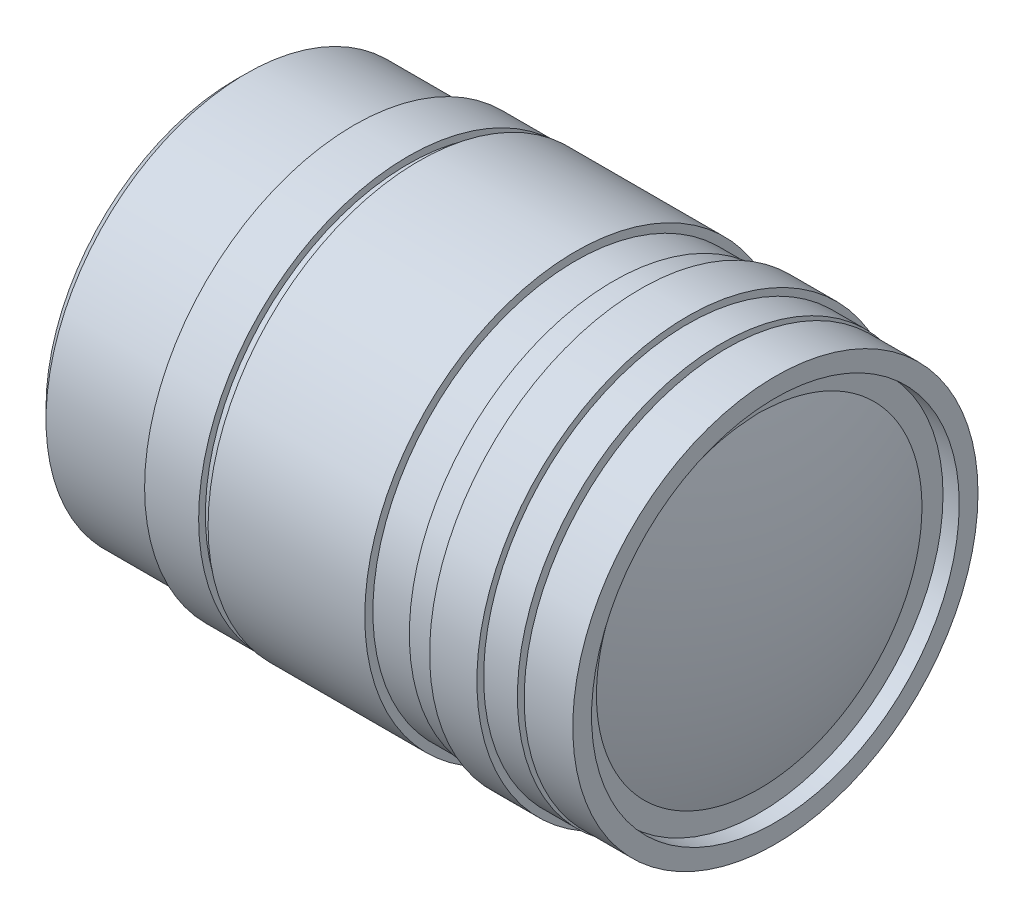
ISO-10303-21;
HEADER;
FILE_DESCRIPTION(('STEP AP214'),'2;1');
FILE_NAME('part.step','',(''),(''),'','','');
FILE_SCHEMA(('AUTOMOTIVE_DESIGN { 1 0 10303 214 1 1 1 1 }'));
ENDSEC;
DATA;
#1=APPLICATION_CONTEXT('core data for automotive mechanical design processes');
#2=APPLICATION_PROTOCOL_DEFINITION('international standard','automotive_design',2000,#1);
#3=PRODUCT_CONTEXT('',#1,'mechanical');
#4=PRODUCT('Part','Part','',(#3));
#5=PRODUCT_RELATED_PRODUCT_CATEGORY('part','',(#4));
#6=PRODUCT_DEFINITION_FORMATION('','',#4);
#7=PRODUCT_DEFINITION_CONTEXT('part definition',#1,'design');
#8=PRODUCT_DEFINITION('design','',#6,#7);
#9=PRODUCT_DEFINITION_SHAPE('','',#8);
#10=(LENGTH_UNIT() NAMED_UNIT(*) SI_UNIT(.MILLI.,.METRE.));
#11=(NAMED_UNIT(*) PLANE_ANGLE_UNIT() SI_UNIT($,.RADIAN.));
#12=(NAMED_UNIT(*) SI_UNIT($,.STERADIAN.) SOLID_ANGLE_UNIT());
#13=UNCERTAINTY_MEASURE_WITH_UNIT(LENGTH_MEASURE(1.E-05),#10,'distance_accuracy_value','');
#14=(GEOMETRIC_REPRESENTATION_CONTEXT(3) GLOBAL_UNCERTAINTY_ASSIGNED_CONTEXT((#13)) GLOBAL_UNIT_ASSIGNED_CONTEXT((#10,
#11,#12)) REPRESENTATION_CONTEXT('',''));
#15=CARTESIAN_POINT('',(0.,0.,0.));
#16=DIRECTION('',(0.,0.,1.));
#17=DIRECTION('',(1.,0.,0.));
#18=AXIS2_PLACEMENT_3D('',#15,#16,#17);
#19=CARTESIAN_POINT('',(0.,0.,0.));
#20=DIRECTION('',(-0.999985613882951,-0.00536395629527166,0.));
#21=DIRECTION('',(-0.00536395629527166,0.999985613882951,0.));
#22=AXIS2_PLACEMENT_3D('',#19,#20,#21);
#23=SPHERICAL_SURFACE('',#22,101.58576898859);
#24=CARTESIAN_POINT('',(95.2123995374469,0.510722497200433,0.));
#25=DIRECTION('',(-0.999985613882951,-0.00536395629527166,0.));
#26=DIRECTION('',(0.00536395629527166,-0.999985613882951,0.));
#27=AXIS2_PLACEMENT_3D('',#24,#25,#26);
#28=CIRCLE('',#27,35.4119555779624);
#29=CARTESIAN_POINT('',(95.4023477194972,-34.9007236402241,0.));
#30=VERTEX_POINT('',#29);
#31=EDGE_CURVE('E58',#30,#30,#28,.T.);
#32=ORIENTED_EDGE('',*,*,#31,.F.);
#33=EDGE_LOOP('',(#32));
#34=FACE_BOUND('',#33,.T.);
#35=ADVANCED_FACE('F51',(#34),#23,.T.);
#36=CARTESIAN_POINT('',(92.5515747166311,0.496449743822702,0.));
#37=DIRECTION('',(0.999985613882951,0.00536395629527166,0.));
#38=DIRECTION('',(-0.00536395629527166,0.999985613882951,0.));
#39=AXIS2_PLACEMENT_3D('',#36,#37,#38);
#40=CONICAL_SURFACE('',#39,35.4262285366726,1.56543234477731);
#41=CARTESIAN_POINT('',(92.361549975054,0.495430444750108,0.));
#42=VERTEX_POINT('',#41);
#43=VERTEX_LOOP('',#42);
#44=FACE_BOUND('',#43,.T.);
#45=CARTESIAN_POINT('',(92.5515747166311,0.496449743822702,0.));
#46=DIRECTION('',(-0.999985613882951,-0.00536395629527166,0.));
#47=DIRECTION('',(0.00536395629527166,-0.999985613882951,0.));
#48=AXIS2_PLACEMENT_3D('',#45,#46,#47);
#49=CIRCLE('',#48,35.4262285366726);
#50=CARTESIAN_POINT('',(92.7415994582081,-34.9292691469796,0.));
#51=VERTEX_POINT('',#50);
#52=EDGE_CURVE('E12',#51,#51,#49,.T.);
#53=ORIENTED_EDGE('',*,*,#52,.T.);
#54=EDGE_LOOP('',(#53));
#55=FACE_BOUND('',#54,.T.);
#56=ADVANCED_FACE('F62',(#44,#55),#40,.T.);
#57=CARTESIAN_POINT('',(95.2123995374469,0.510722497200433,0.));
#58=DIRECTION('',(-0.999985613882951,-0.00536395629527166,0.));
#59=DIRECTION('',(0.00536395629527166,-0.999985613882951,0.));
#60=AXIS2_PLACEMENT_3D('',#57,#58,#59);
#61=CONICAL_SURFACE('',#60,35.4119555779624,0.0053639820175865);
#62=ORIENTED_EDGE('',*,*,#52,.F.);
#63=EDGE_LOOP('',(#62));
#64=FACE_BOUND('',#63,.T.);
#65=ORIENTED_EDGE('',*,*,#31,.T.);
#66=EDGE_LOOP('',(#65));
#67=FACE_BOUND('',#66,.T.);
#68=ADVANCED_FACE('F65',(#64,#67),#61,.T.);
#69=CLOSED_SHELL('',(#35,#56,#68));
#70=MANIFOLD_SOLID_BREP('B2',#69);
#71=CARTESIAN_POINT('',(83.75,0.,0.));
#72=DIRECTION('',(-1.,0.,0.));
#73=DIRECTION('',(0.,0.,1.));
#74=AXIS2_PLACEMENT_3D('',#71,#72,#73);
#75=CYLINDRICAL_SURFACE('',#74,39.);
#76=CARTESIAN_POINT('',(83.75,0.,0.));
#77=DIRECTION('',(1.,0.,0.));
#78=DIRECTION('',(0.,0.,-1.));
#79=AXIS2_PLACEMENT_3D('',#76,#77,#78);
#80=CIRCLE('',#79,39.);
#81=CARTESIAN_POINT('',(83.75,0.,-39.));
#82=VERTEX_POINT('',#81);
#83=EDGE_CURVE('E50',#82,#82,#80,.T.);
#84=ORIENTED_EDGE('',*,*,#83,.F.);
#85=EDGE_LOOP('',(#84));
#86=FACE_BOUND('',#85,.T.);
#87=CARTESIAN_POINT('',(75.,0.,0.));
#88=DIRECTION('',(1.,0.,0.));
#89=DIRECTION('',(0.,0.,-1.));
#90=AXIS2_PLACEMENT_3D('',#87,#88,#89);
#91=CIRCLE('',#90,39.);
#92=CARTESIAN_POINT('',(75.,0.,-39.));
#93=VERTEX_POINT('',#92);
#94=EDGE_CURVE('E110',#93,#93,#91,.T.);
#95=ORIENTED_EDGE('',*,*,#94,.T.);
#96=EDGE_LOOP('',(#95));
#97=FACE_BOUND('',#96,.T.);
#98=ADVANCED_FACE('F107',(#86,#97),#75,.T.);
#99=CARTESIAN_POINT('',(83.75,0.,0.));
#100=DIRECTION('',(1.,0.,0.));
#101=DIRECTION('',(0.,0.,-1.));
#102=AXIS2_PLACEMENT_3D('',#99,#100,#101);
#103=PLANE('',#102);
#104=ORIENTED_EDGE('',*,*,#83,.T.);
#105=EDGE_LOOP('',(#104));
#106=FACE_BOUND('',#105,.T.);
#107=ADVANCED_FACE('F124',(#106),#103,.T.);
#108=CARTESIAN_POINT('',(75.,0.,0.));
#109=DIRECTION('',(1.,0.,0.));
#110=DIRECTION('',(0.,0.,-1.));
#111=AXIS2_PLACEMENT_3D('',#108,#109,#110);
#112=PLANE('',#111);
#113=ORIENTED_EDGE('',*,*,#94,.F.);
#114=EDGE_LOOP('',(#113));
#115=FACE_BOUND('',#114,.T.);
#116=ADVANCED_FACE('F122',(#115),#112,.F.);
#117=CLOSED_SHELL('',(#98,#107,#116));
#118=MANIFOLD_SOLID_BREP('B6',#117);
#119=CARTESIAN_POINT('',(63.,0.,0.));
#120=DIRECTION('',(-1.,0.,0.));
#121=DIRECTION('',(0.,0.,1.));
#122=AXIS2_PLACEMENT_3D('',#119,#120,#121);
#123=CYLINDRICAL_SURFACE('',#122,39.);
#124=CARTESIAN_POINT('',(63.,0.,0.));
#125=DIRECTION('',(1.,0.,0.));
#126=DIRECTION('',(0.,0.,-1.));
#127=AXIS2_PLACEMENT_3D('',#124,#125,#126);
#128=CIRCLE('',#127,39.);
#129=CARTESIAN_POINT('',(63.,0.,39.));
#130=VERTEX_POINT('',#129);
#131=EDGE_CURVE('E106',#130,#130,#128,.T.);
#132=CARTESIAN_POINT('',(34.,0.,0.));
#133=DIRECTION('',(1.,0.,0.));
#134=DIRECTION('',(0.,0.,-1.));
#135=AXIS2_PLACEMENT_3D('',#132,#133,#134);
#136=CIRCLE('',#135,39.);
#137=CARTESIAN_POINT('',(34.,0.,39.));
#138=VERTEX_POINT('',#137);
#139=EDGE_CURVE('E161',#138,#138,#136,.T.);
#140=CARTESIAN_POINT('',(63.,0.,39.));
#141=CARTESIAN_POINT('',(62.6979166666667,0.,39.));
#142=CARTESIAN_POINT('',(62.3958333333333,0.,39.));
#143=CARTESIAN_POINT('',(61.7916666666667,0.,39.));
#144=CARTESIAN_POINT('',(61.4895833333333,0.,39.));
#145=CARTESIAN_POINT('',(60.8854166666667,0.,39.));
#146=CARTESIAN_POINT('',(60.5833333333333,0.,39.));
#147=CARTESIAN_POINT('',(59.9791666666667,0.,39.));
#148=CARTESIAN_POINT('',(59.6770833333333,0.,39.));
#149=CARTESIAN_POINT('',(59.0729166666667,0.,39.));
#150=CARTESIAN_POINT('',(58.7708333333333,0.,39.));
#151=CARTESIAN_POINT('',(58.1666666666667,0.,39.));
#152=CARTESIAN_POINT('',(57.8645833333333,0.,39.));
#153=CARTESIAN_POINT('',(57.2604166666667,0.,39.));
#154=CARTESIAN_POINT('',(56.9583333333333,0.,39.));
#155=CARTESIAN_POINT('',(56.3541666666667,0.,39.));
#156=CARTESIAN_POINT('',(56.0520833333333,0.,39.));
#157=CARTESIAN_POINT('',(55.4479166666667,0.,39.));
#158=CARTESIAN_POINT('',(55.1458333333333,0.,39.));
#159=CARTESIAN_POINT('',(54.5416666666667,0.,39.));
#160=CARTESIAN_POINT('',(54.2395833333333,0.,39.));
#161=CARTESIAN_POINT('',(53.6354166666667,0.,39.));
#162=CARTESIAN_POINT('',(53.3333333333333,0.,39.));
#163=CARTESIAN_POINT('',(52.7291666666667,0.,39.));
#164=CARTESIAN_POINT('',(52.4270833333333,0.,39.));
#165=CARTESIAN_POINT('',(51.8229166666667,0.,39.));
#166=CARTESIAN_POINT('',(51.5208333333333,0.,39.));
#167=CARTESIAN_POINT('',(50.9166666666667,0.,39.));
#168=CARTESIAN_POINT('',(50.6145833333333,0.,39.));
#169=CARTESIAN_POINT('',(50.0104166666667,0.,39.));
#170=CARTESIAN_POINT('',(49.7083333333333,0.,39.));
#171=CARTESIAN_POINT('',(49.1041666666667,0.,39.));
#172=CARTESIAN_POINT('',(48.8020833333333,0.,39.));
#173=CARTESIAN_POINT('',(48.1979166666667,0.,39.));
#174=CARTESIAN_POINT('',(47.8958333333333,0.,39.));
#175=CARTESIAN_POINT('',(47.2916666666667,0.,39.));
#176=CARTESIAN_POINT('',(46.9895833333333,0.,39.));
#177=CARTESIAN_POINT('',(46.3854166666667,0.,39.));
#178=CARTESIAN_POINT('',(46.0833333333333,0.,39.));
#179=CARTESIAN_POINT('',(45.4791666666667,0.,39.));
#180=CARTESIAN_POINT('',(45.1770833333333,0.,39.));
#181=CARTESIAN_POINT('',(44.5729166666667,0.,39.));
#182=CARTESIAN_POINT('',(44.2708333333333,0.,39.));
#183=CARTESIAN_POINT('',(43.6666666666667,0.,39.));
#184=CARTESIAN_POINT('',(43.3645833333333,0.,39.));
#185=CARTESIAN_POINT('',(42.7604166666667,0.,39.));
#186=CARTESIAN_POINT('',(42.4583333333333,0.,39.));
#187=CARTESIAN_POINT('',(41.8541666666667,0.,39.));
#188=CARTESIAN_POINT('',(41.5520833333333,0.,39.));
#189=CARTESIAN_POINT('',(40.9479166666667,0.,39.));
#190=CARTESIAN_POINT('',(40.6458333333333,0.,39.));
#191=CARTESIAN_POINT('',(40.0416666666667,0.,39.));
#192=CARTESIAN_POINT('',(39.7395833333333,0.,39.));
#193=CARTESIAN_POINT('',(39.1354166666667,0.,39.));
#194=CARTESIAN_POINT('',(38.8333333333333,0.,39.));
#195=CARTESIAN_POINT('',(38.2291666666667,0.,39.));
#196=CARTESIAN_POINT('',(37.9270833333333,0.,39.));
#197=CARTESIAN_POINT('',(37.3229166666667,0.,39.));
#198=CARTESIAN_POINT('',(37.0208333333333,0.,39.));
#199=CARTESIAN_POINT('',(36.4166666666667,0.,39.));
#200=CARTESIAN_POINT('',(36.1145833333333,0.,39.));
#201=CARTESIAN_POINT('',(35.5104166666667,0.,39.));
#202=CARTESIAN_POINT('',(35.2083333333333,0.,39.));
#203=CARTESIAN_POINT('',(34.6041666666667,0.,39.));
#204=CARTESIAN_POINT('',(34.3020833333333,0.,39.));
#205=CARTESIAN_POINT('',(34.,0.,39.));
#206=B_SPLINE_CURVE_WITH_KNOTS('',3,(#140,#141,#142,#143,#144,#145,#146,#147,#148,#149,#150,
#151,#152,#153,#154,#155,#156,#157,#158,#159,#160,#161,#162,#163,#164,#165,#166,#167,#168,#169,
#170,#171,#172,#173,#174,#175,#176,#177,#178,#179,#180,#181,#182,#183,#184,#185,#186,#187,#188,
#189,#190,#191,#192,#193,#194,#195,#196,#197,#198,#199,#200,#201,#202,#203,#204,#205),
.UNSPECIFIED.,.F.,.F.,(4,2,2,2,2,2,2,2,2,2,2,2,2,2,2,2,2,2,2,2,2,2,2,2,2,2,2,2,2,2,2,2,4),(0.,
0.90624999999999,1.81249999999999,2.71874999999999,3.62499999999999,4.53124999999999,
5.43749999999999,6.34375,7.24999999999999,8.15624999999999,9.06249999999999,9.96874999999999,
10.875,11.78125,12.6875,13.59375,14.5,15.40625,16.3125,17.21875,18.125,19.03125,19.9375,
20.84375,21.75,22.65625,23.5625,24.46875,25.375,26.28125,27.1875,28.09375,29.),.UNSPECIFIED.);
#207=EDGE_CURVE('BSEAM158',#130,#138,#206,.T.);
#208=ORIENTED_EDGE('',*,*,#131,.F.);
#209=ORIENTED_EDGE('',*,*,#139,.T.);
#210=ORIENTED_EDGE('',*,*,#207,.T.);
#211=ORIENTED_EDGE('',*,*,#207,.F.);
#212=EDGE_LOOP('',(#208,#210,#209,#211));
#213=FACE_BOUND('',#212,.T.);
#214=ADVANCED_FACE('F158',(#213),#123,.T.);
#215=CARTESIAN_POINT('',(63.,0.,0.));
#216=DIRECTION('',(1.,0.,0.));
#217=DIRECTION('',(0.,0.,-1.));
#218=AXIS2_PLACEMENT_3D('',#215,#216,#217);
#219=PLANE('',#218);
#220=ORIENTED_EDGE('',*,*,#131,.T.);
#221=EDGE_LOOP('',(#220));
#222=FACE_BOUND('',#221,.T.);
#223=ADVANCED_FACE('F175',(#222),#219,.T.);
#224=CARTESIAN_POINT('',(34.,0.,0.));
#225=DIRECTION('',(1.,0.,0.));
#226=DIRECTION('',(0.,0.,-1.));
#227=AXIS2_PLACEMENT_3D('',#224,#225,#226);
#228=PLANE('',#227);
#229=ORIENTED_EDGE('',*,*,#139,.F.);
#230=EDGE_LOOP('',(#229));
#231=FACE_BOUND('',#230,.T.);
#232=ADVANCED_FACE('F173',(#231),#228,.F.);
#233=CLOSED_SHELL('',(#214,#223,#232));
#234=MANIFOLD_SOLID_BREP('B45',#233);
#235=CARTESIAN_POINT('',(93.,0.,0.));
#236=DIRECTION('',(-1.,0.,0.));
#237=DIRECTION('',(0.,0.,1.));
#238=AXIS2_PLACEMENT_3D('',#235,#236,#237);
#239=CYLINDRICAL_SURFACE('',#238,35.);
#240=CARTESIAN_POINT('',(90.,0.,0.));
#241=DIRECTION('',(1.,0.,0.));
#242=DIRECTION('',(0.,0.,-1.));
#243=AXIS2_PLACEMENT_3D('',#240,#241,#242);
#244=CIRCLE('',#243,35.);
#245=CARTESIAN_POINT('',(90.,0.,-35.));
#246=VERTEX_POINT('',#245);
#247=EDGE_CURVE('E261',#246,#246,#244,.T.);
#248=ORIENTED_EDGE('',*,*,#247,.T.);
#249=EDGE_LOOP('',(#248));
#250=FACE_BOUND('',#249,.T.);
#251=CARTESIAN_POINT('',(91.,0.,0.));
#252=DIRECTION('',(1.,0.,0.));
#253=DIRECTION('',(0.,0.,-1.));
#254=AXIS2_PLACEMENT_3D('',#251,#252,#253);
#255=CIRCLE('',#254,35.);
#256=CARTESIAN_POINT('',(91.,0.,-35.));
#257=VERTEX_POINT('',#256);
#258=EDGE_CURVE('E230',#257,#257,#255,.T.);
#259=ORIENTED_EDGE('',*,*,#258,.F.);
#260=EDGE_LOOP('',(#259));
#261=FACE_BOUND('',#260,.T.);
#262=ADVANCED_FACE('F216',(#250,#261),#239,.T.);
#263=CARTESIAN_POINT('',(90.,0.,0.));
#264=DIRECTION('',(1.,0.,0.));
#265=DIRECTION('',(0.,0.,-1.));
#266=AXIS2_PLACEMENT_3D('',#263,#264,#265);
#267=PLANE('',#266);
#268=CARTESIAN_POINT('',(90.,0.,0.));
#269=DIRECTION('',(1.,0.,0.));
#270=DIRECTION('',(0.,0.,-1.));
#271=AXIS2_PLACEMENT_3D('',#268,#269,#270);
#272=CIRCLE('',#271,37.75);
#273=CARTESIAN_POINT('',(90.,0.,-37.75));
#274=VERTEX_POINT('',#273);
#275=EDGE_CURVE('E253',#274,#274,#272,.T.);
#276=ORIENTED_EDGE('',*,*,#275,.T.);
#277=EDGE_LOOP('',(#276));
#278=FACE_BOUND('',#277,.T.);
#279=ORIENTED_EDGE('',*,*,#247,.F.);
#280=EDGE_LOOP('',(#279));
#281=FACE_BOUND('',#280,.T.);
#282=ADVANCED_FACE('F313',(#278,#281),#267,.T.);
#283=CARTESIAN_POINT('',(32.,0.,0.));
#284=DIRECTION('',(1.,0.,0.));
#285=DIRECTION('',(0.,0.,-1.));
#286=AXIS2_PLACEMENT_3D('',#283,#284,#285);
#287=PLANE('',#286);
#288=CARTESIAN_POINT('',(32.,0.,0.));
#289=DIRECTION('',(1.,0.,0.));
#290=DIRECTION('',(0.,0.,-1.));
#291=AXIS2_PLACEMENT_3D('',#288,#289,#290);
#292=CIRCLE('',#291,38.75);
#293=CARTESIAN_POINT('',(32.,0.,-38.75));
#294=VERTEX_POINT('',#293);
#295=EDGE_CURVE('E241',#294,#294,#292,.T.);
#296=ORIENTED_EDGE('',*,*,#295,.T.);
#297=EDGE_LOOP('',(#296));
#298=FACE_BOUND('',#297,.T.);
#299=CARTESIAN_POINT('',(32.,0.,0.));
#300=DIRECTION('',(1.,0.,0.));
#301=DIRECTION('',(0.,0.,-1.));
#302=AXIS2_PLACEMENT_3D('',#299,#300,#301);
#303=CIRCLE('',#302,37.5);
#304=CARTESIAN_POINT('',(32.,0.,-37.5));
#305=VERTEX_POINT('',#304);
#306=EDGE_CURVE('E249',#305,#305,#303,.T.);
#307=ORIENTED_EDGE('',*,*,#306,.F.);
#308=EDGE_LOOP('',(#307));
#309=FACE_BOUND('',#308,.T.);
#310=ADVANCED_FACE('F319',(#298,#309),#287,.T.);
#311=CARTESIAN_POINT('',(22.,0.,0.));
#312=DIRECTION('',(-1.,0.,0.));
#313=DIRECTION('',(0.,0.,1.));
#314=AXIS2_PLACEMENT_3D('',#311,#312,#313);
#315=CYLINDRICAL_SURFACE('',#314,37.);
#316=CARTESIAN_POINT('',(2.00000000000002,0.,0.));
#317=DIRECTION('',(1.,0.,0.));
#318=DIRECTION('',(0.,0.,-1.));
#319=AXIS2_PLACEMENT_3D('',#316,#317,#318);
#320=CIRCLE('',#319,37.);
#321=CARTESIAN_POINT('',(2.00000000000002,0.,-37.));
#322=VERTEX_POINT('',#321);
#323=EDGE_CURVE('E224',#322,#322,#320,.T.);
#324=ORIENTED_EDGE('',*,*,#323,.T.);
#325=EDGE_LOOP('',(#324));
#326=FACE_BOUND('',#325,.T.);
#327=CARTESIAN_POINT('',(22.,0.,0.));
#328=DIRECTION('',(1.,0.,0.));
#329=DIRECTION('',(0.,0.,-1.));
#330=AXIS2_PLACEMENT_3D('',#327,#328,#329);
#331=CIRCLE('',#330,37.);
#332=CARTESIAN_POINT('',(22.,0.,-37.));
#333=VERTEX_POINT('',#332);
#334=EDGE_CURVE('E235',#333,#333,#331,.T.);
#335=ORIENTED_EDGE('',*,*,#334,.F.);
#336=EDGE_LOOP('',(#335));
#337=FACE_BOUND('',#336,.T.);
#338=ADVANCED_FACE('F337',(#326,#337),#315,.T.);
#339=CARTESIAN_POINT('',(0.,0.,0.));
#340=DIRECTION('',(1.,0.,0.));
#341=DIRECTION('',(0.,0.,-1.));
#342=AXIS2_PLACEMENT_3D('',#339,#340,#341);
#343=PLANE('',#342);
#344=CARTESIAN_POINT('',(0.,0.,0.));
#345=DIRECTION('',(1.,0.,0.));
#346=DIRECTION('',(0.,0.,-1.));
#347=AXIS2_PLACEMENT_3D('',#344,#345,#346);
#348=CIRCLE('',#347,35.);
#349=CARTESIAN_POINT('',(0.,0.,-35.));
#350=VERTEX_POINT('',#349);
#351=EDGE_CURVE('E157',#350,#350,#348,.F.);
#352=ORIENTED_EDGE('',*,*,#351,.T.);
#353=EDGE_LOOP('',(#352));
#354=FACE_BOUND('',#353,.T.);
#355=ADVANCED_FACE('F342',(#354),#343,.F.);
#356=CARTESIAN_POINT('',(22.,0.,0.));
#357=DIRECTION('',(1.,0.,0.));
#358=DIRECTION('',(0.,0.,-1.));
#359=AXIS2_PLACEMENT_3D('',#356,#357,#358);
#360=PLANE('',#359);
#361=CARTESIAN_POINT('',(22.,0.,0.));
#362=DIRECTION('',(1.,0.,0.));
#363=DIRECTION('',(0.,0.,-1.));
#364=AXIS2_PLACEMENT_3D('',#361,#362,#363);
#365=CIRCLE('',#364,38.75);
#366=CARTESIAN_POINT('',(22.,0.,-38.75));
#367=VERTEX_POINT('',#366);
#368=EDGE_CURVE('E242',#367,#367,#365,.T.);
#369=ORIENTED_EDGE('',*,*,#368,.F.);
#370=EDGE_LOOP('',(#369));
#371=FACE_BOUND('',#370,.T.);
#372=ORIENTED_EDGE('',*,*,#334,.T.);
#373=EDGE_LOOP('',(#372));
#374=FACE_BOUND('',#373,.T.);
#375=ADVANCED_FACE('F339',(#371,#374),#360,.F.);
#376=CARTESIAN_POINT('',(32.,0.,0.));
#377=DIRECTION('',(-1.,0.,0.));
#378=DIRECTION('',(0.,0.,1.));
#379=AXIS2_PLACEMENT_3D('',#376,#377,#378);
#380=CYLINDRICAL_SURFACE('',#379,38.75);
#381=ORIENTED_EDGE('',*,*,#295,.F.);
#382=EDGE_LOOP('',(#381));
#383=FACE_BOUND('',#382,.T.);
#384=ORIENTED_EDGE('',*,*,#368,.T.);
#385=EDGE_LOOP('',(#384));
#386=FACE_BOUND('',#385,.T.);
#387=ADVANCED_FACE('F333',(#383,#386),#380,.T.);
#388=CARTESIAN_POINT('',(70.,0.,0.));
#389=DIRECTION('',(-1.,0.,0.));
#390=DIRECTION('',(0.,0.,1.));
#391=AXIS2_PLACEMENT_3D('',#388,#389,#390);
#392=CYLINDRICAL_SURFACE('',#391,37.5);
#393=CARTESIAN_POINT('',(70.,0.,0.));
#394=DIRECTION('',(1.,0.,0.));
#395=DIRECTION('',(0.,0.,-1.));
#396=AXIS2_PLACEMENT_3D('',#393,#394,#395);
#397=CIRCLE('',#396,37.5);
#398=CARTESIAN_POINT('',(70.,0.,-37.5));
#399=VERTEX_POINT('',#398);
#400=EDGE_CURVE('E245',#399,#399,#397,.T.);
#401=ORIENTED_EDGE('',*,*,#400,.F.);
#402=EDGE_LOOP('',(#401));
#403=FACE_BOUND('',#402,.T.);
#404=ORIENTED_EDGE('',*,*,#306,.T.);
#405=EDGE_LOOP('',(#404));
#406=FACE_BOUND('',#405,.T.);
#407=ADVANCED_FACE('F326',(#403,#406),#392,.T.);
#408=CARTESIAN_POINT('',(70.,0.,0.));
#409=DIRECTION('',(1.,0.,0.));
#410=DIRECTION('',(0.,0.,-1.));
#411=AXIS2_PLACEMENT_3D('',#408,#409,#410);
#412=PLANE('',#411);
#413=CARTESIAN_POINT('',(70.,0.,0.));
#414=DIRECTION('',(1.,0.,0.));
#415=DIRECTION('',(0.,0.,-1.));
#416=AXIS2_PLACEMENT_3D('',#413,#414,#415);
#417=CIRCLE('',#416,37.75);
#418=CARTESIAN_POINT('',(70.,0.,-37.75));
#419=VERTEX_POINT('',#418);
#420=EDGE_CURVE('E257',#419,#419,#417,.T.);
#421=ORIENTED_EDGE('',*,*,#420,.F.);
#422=EDGE_LOOP('',(#421));
#423=FACE_BOUND('',#422,.T.);
#424=ORIENTED_EDGE('',*,*,#400,.T.);
#425=EDGE_LOOP('',(#424));
#426=FACE_BOUND('',#425,.T.);
#427=ADVANCED_FACE('F323',(#423,#426),#412,.F.);
#428=CARTESIAN_POINT('',(90.,0.,0.));
#429=DIRECTION('',(-1.,0.,0.));
#430=DIRECTION('',(0.,0.,1.));
#431=AXIS2_PLACEMENT_3D('',#428,#429,#430);
#432=CYLINDRICAL_SURFACE('',#431,37.75);
#433=ORIENTED_EDGE('',*,*,#275,.F.);
#434=EDGE_LOOP('',(#433));
#435=FACE_BOUND('',#434,.T.);
#436=ORIENTED_EDGE('',*,*,#420,.T.);
#437=EDGE_LOOP('',(#436));
#438=FACE_BOUND('',#437,.T.);
#439=ADVANCED_FACE('F308',(#435,#438),#432,.T.);
#440=CARTESIAN_POINT('',(91.,0.,0.));
#441=DIRECTION('',(1.,0.,0.));
#442=DIRECTION('',(0.,0.,-1.));
#443=AXIS2_PLACEMENT_3D('',#440,#441,#442);
#444=PLANE('',#443);
#445=CARTESIAN_POINT('',(91.,0.,0.));
#446=DIRECTION('',(1.,0.,0.));
#447=DIRECTION('',(0.,0.,-1.));
#448=AXIS2_PLACEMENT_3D('',#445,#446,#447);
#449=CIRCLE('',#448,37.5);
#450=CARTESIAN_POINT('',(91.,0.,-37.5));
#451=VERTEX_POINT('',#450);
#452=EDGE_CURVE('E269',#451,#451,#449,.T.);
#453=ORIENTED_EDGE('',*,*,#452,.F.);
#454=EDGE_LOOP('',(#453));
#455=FACE_BOUND('',#454,.T.);
#456=ORIENTED_EDGE('',*,*,#258,.T.);
#457=EDGE_LOOP('',(#456));
#458=FACE_BOUND('',#457,.T.);
#459=ADVANCED_FACE('F302',(#455,#458),#444,.F.);
#460=CARTESIAN_POINT('',(100.,0.,0.));
#461=DIRECTION('',(-1.,0.,0.));
#462=DIRECTION('',(0.,0.,1.));
#463=AXIS2_PLACEMENT_3D('',#460,#461,#462);
#464=CYLINDRICAL_SURFACE('',#463,37.5);
#465=CARTESIAN_POINT('',(100.,0.,0.));
#466=DIRECTION('',(1.,0.,0.));
#467=DIRECTION('',(0.,0.,-1.));
#468=AXIS2_PLACEMENT_3D('',#465,#466,#467);
#469=CIRCLE('',#468,37.5);
#470=CARTESIAN_POINT('',(100.,0.,-37.5));
#471=VERTEX_POINT('',#470);
#472=EDGE_CURVE('E268',#471,#471,#469,.T.);
#473=ORIENTED_EDGE('',*,*,#472,.F.);
#474=EDGE_LOOP('',(#473));
#475=FACE_BOUND('',#474,.T.);
#476=ORIENTED_EDGE('',*,*,#452,.T.);
#477=EDGE_LOOP('',(#476));
#478=FACE_BOUND('',#477,.T.);
#479=ADVANCED_FACE('F296',(#475,#478),#464,.T.);
#480=CARTESIAN_POINT('',(100.,0.,0.));
#481=DIRECTION('',(1.,0.,0.));
#482=DIRECTION('',(0.,0.,-1.));
#483=AXIS2_PLACEMENT_3D('',#480,#481,#482);
#484=PLANE('',#483);
#485=CARTESIAN_POINT('',(100.,0.,0.));
#486=DIRECTION('',(1.,0.,0.));
#487=DIRECTION('',(0.,0.,-1.));
#488=AXIS2_PLACEMENT_3D('',#485,#486,#487);
#489=CIRCLE('',#488,34.0268255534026);
#490=CARTESIAN_POINT('',(100.,0.,-34.0268255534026));
#491=VERTEX_POINT('',#490);
#492=EDGE_CURVE('E277',#491,#491,#489,.T.);
#493=ORIENTED_EDGE('',*,*,#492,.F.);
#494=EDGE_LOOP('',(#493));
#495=FACE_BOUND('',#494,.T.);
#496=ORIENTED_EDGE('',*,*,#472,.T.);
#497=EDGE_LOOP('',(#496));
#498=FACE_BOUND('',#497,.T.);
#499=ADVANCED_FACE('F293',(#495,#498),#484,.T.);
#500=CARTESIAN_POINT('',(2.00000000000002,0.,0.));
#501=DIRECTION('',(1.,0.,0.));
#502=DIRECTION('',(0.,0.,-1.));
#503=AXIS2_PLACEMENT_3D('',#500,#501,#502);
#504=CONICAL_SURFACE('',#503,37.,0.785398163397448);
#505=ORIENTED_EDGE('',*,*,#351,.F.);
#506=EDGE_LOOP('',(#505));
#507=FACE_BOUND('',#506,.T.);
#508=ORIENTED_EDGE('',*,*,#323,.F.);
#509=EDGE_LOOP('',(#508));
#510=FACE_BOUND('',#509,.T.);
#511=ADVANCED_FACE('F218',(#507,#510),#504,.T.);
#512=CARTESIAN_POINT('',(97.,0.,0.));
#513=DIRECTION('',(1.,0.,0.));
#514=DIRECTION('',(0.,0.,-1.));
#515=AXIS2_PLACEMENT_3D('',#512,#513,#514);
#516=CYLINDRICAL_SURFACE('',#515,34.0268255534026);
#517=CARTESIAN_POINT('',(97.,0.,0.));
#518=DIRECTION('',(1.,0.,0.));
#519=DIRECTION('',(0.,0.,-1.));
#520=AXIS2_PLACEMENT_3D('',#517,#518,#519);
#521=CIRCLE('',#520,34.0268255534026);
#522=CARTESIAN_POINT('',(97.,0.,-34.0268255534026));
#523=VERTEX_POINT('',#522);
#524=EDGE_CURVE('E273',#523,#523,#521,.T.);
#525=ORIENTED_EDGE('',*,*,#524,.F.);
#526=EDGE_LOOP('',(#525));
#527=FACE_BOUND('',#526,.T.);
#528=ORIENTED_EDGE('',*,*,#492,.T.);
#529=EDGE_LOOP('',(#528));
#530=FACE_BOUND('',#529,.T.);
#531=ADVANCED_FACE('F287',(#527,#530),#516,.F.);
#532=CARTESIAN_POINT('',(97.,0.,0.));
#533=DIRECTION('',(1.,0.,0.));
#534=DIRECTION('',(0.,0.,-1.));
#535=AXIS2_PLACEMENT_3D('',#532,#533,#534);
#536=PLANE('',#535);
#537=ORIENTED_EDGE('',*,*,#524,.T.);
#538=EDGE_LOOP('',(#537));
#539=FACE_BOUND('',#538,.T.);
#540=ADVANCED_FACE('F285',(#539),#536,.T.);
#541=CLOSED_SHELL('',(#262,#282,#310,#338,#355,#375,#387,#407,#427,#439,#459,#479,#499,#511,
#531,#540));
#542=MANIFOLD_SOLID_BREP('B101',#541);
#543=ADVANCED_BREP_SHAPE_REPRESENTATION('',(#18,#70,#118,#234,#542),#14);
#544=SHAPE_DEFINITION_REPRESENTATION(#9,#543);
ENDSEC;
END-ISO-10303-21;
